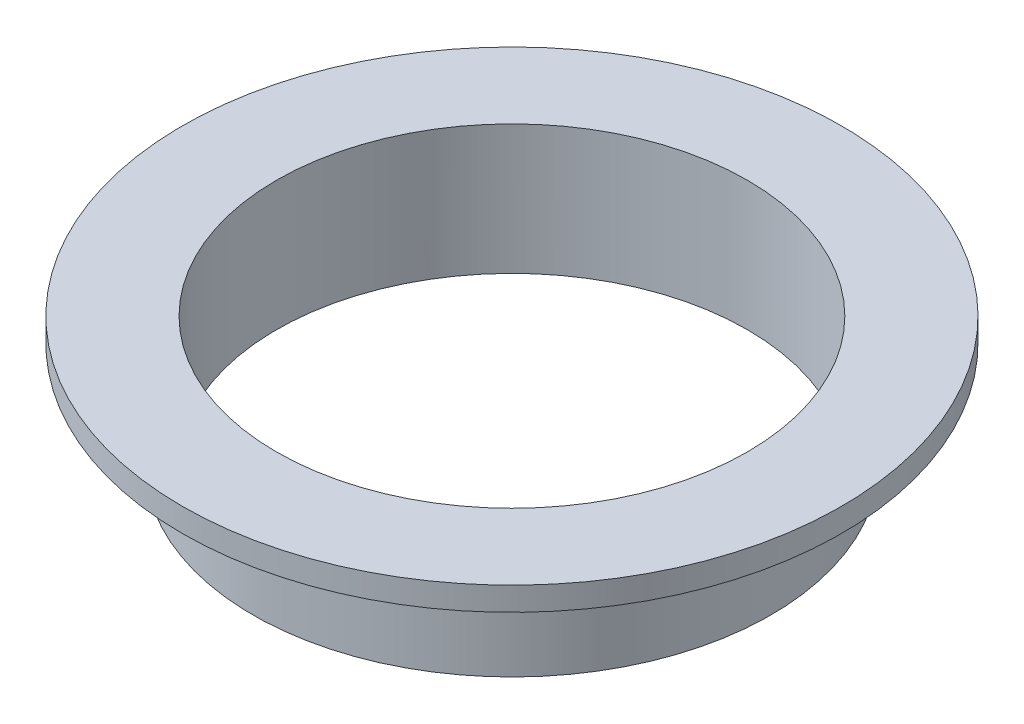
from build123d import *

# Parameters (mm, degrees)
CROQUIS1_R              = 28
SALIENTE_EXTRUIR1_DEPTH = 2
CROQUIS2_R              = 22
SALIENTE_EXTRUIR2_DEPTH = 9
CROQUIS3_R              = 20
CORTAR_EXTRUIR1_DEPTH   = 36


with BuildPart() as part:
    # Croquis1 → Saliente-Extruir1 (new body)
    with BuildSketch(Plane(origin=(0, 0, 0), x_dir=(1, 0, 0), z_dir=(0, 1, 0))):
        with Locations(Location((0, 0, 0), (0, 0, 270))):
            Circle(CROQUIS1_R)
    extrude(amount=SALIENTE_EXTRUIR1_DEPTH)

    # Croquis2 → Saliente-Extruir2 (add)
    with BuildSketch(Plane.XZ):
        with Locations(Location((0, 0, 0), (0, 0, 270))):
            Circle(CROQUIS2_R)
    extrude(amount=SALIENTE_EXTRUIR2_DEPTH)

    # Croquis3 → Cortar-Extruir1 (cut)
    with BuildSketch(Plane.XZ.offset(9)):
        with Locations(Location((0, 0, 0), (0, 0, 270))):
            Circle(CROQUIS3_R)
    extrude(amount=-CORTAR_EXTRUIR1_DEPTH, mode=Mode.SUBTRACT)


solid = part.part
